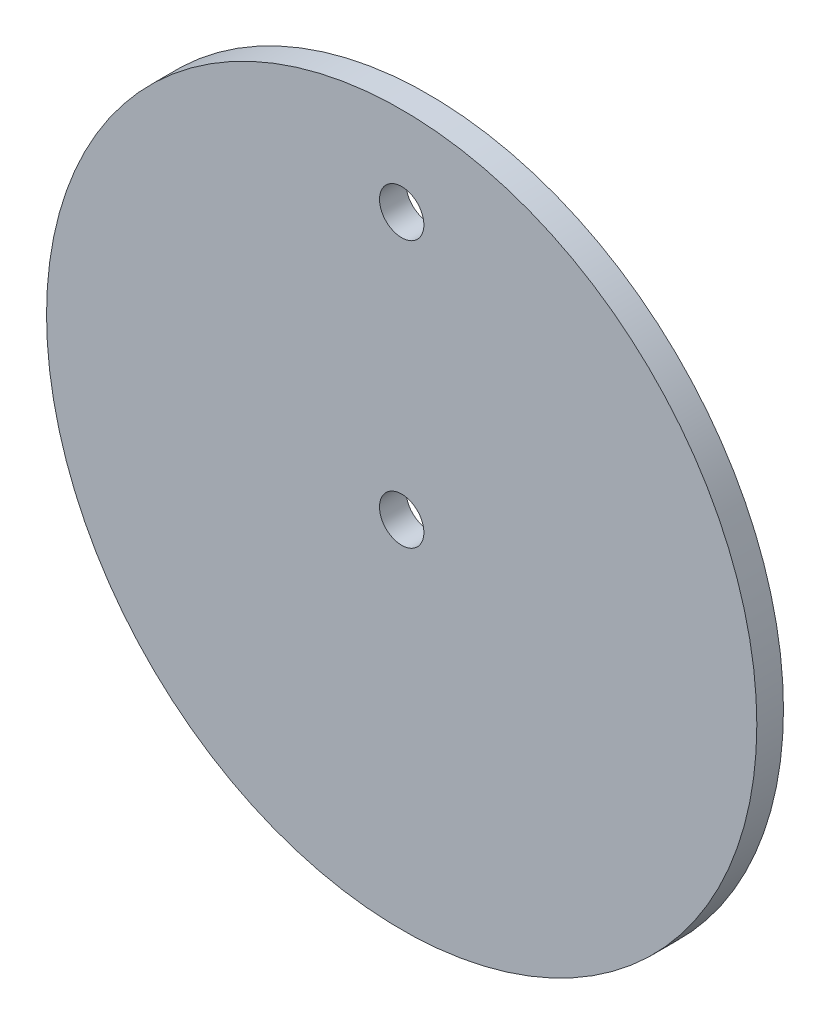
ISO-10303-21;
HEADER;
FILE_DESCRIPTION(('STEP AP214'),'2;1');
FILE_NAME('part.step','',(''),(''),'','','');
FILE_SCHEMA(('AUTOMOTIVE_DESIGN { 1 0 10303 214 1 1 1 1 }'));
ENDSEC;
DATA;
#1=APPLICATION_CONTEXT('core data for automotive mechanical design processes');
#2=APPLICATION_PROTOCOL_DEFINITION('international standard','automotive_design',2000,#1);
#3=PRODUCT_CONTEXT('',#1,'mechanical');
#4=PRODUCT('Part','Part','',(#3));
#5=PRODUCT_RELATED_PRODUCT_CATEGORY('part','',(#4));
#6=PRODUCT_DEFINITION_FORMATION('','',#4);
#7=PRODUCT_DEFINITION_CONTEXT('part definition',#1,'design');
#8=PRODUCT_DEFINITION('design','',#6,#7);
#9=PRODUCT_DEFINITION_SHAPE('','',#8);
#10=(LENGTH_UNIT() NAMED_UNIT(*) SI_UNIT(.MILLI.,.METRE.));
#11=(NAMED_UNIT(*) PLANE_ANGLE_UNIT() SI_UNIT($,.RADIAN.));
#12=(NAMED_UNIT(*) SI_UNIT($,.STERADIAN.) SOLID_ANGLE_UNIT());
#13=UNCERTAINTY_MEASURE_WITH_UNIT(LENGTH_MEASURE(1.E-05),#10,'distance_accuracy_value','');
#14=(GEOMETRIC_REPRESENTATION_CONTEXT(3) GLOBAL_UNCERTAINTY_ASSIGNED_CONTEXT((#13)) GLOBAL_UNIT_ASSIGNED_CONTEXT((#10,
#11,#12)) REPRESENTATION_CONTEXT('',''));
#15=CARTESIAN_POINT('',(0.,0.,0.));
#16=DIRECTION('',(0.,0.,1.));
#17=DIRECTION('',(1.,0.,0.));
#18=AXIS2_PLACEMENT_3D('',#15,#16,#17);
#19=CARTESIAN_POINT('',(0.,0.,3.));
#20=DIRECTION('',(0.,0.,1.));
#21=DIRECTION('',(1.,0.,0.));
#22=AXIS2_PLACEMENT_3D('',#19,#20,#21);
#23=PLANE('',#22);
#24=CARTESIAN_POINT('',(0.,0.,3.));
#25=DIRECTION('',(0.,0.,1.));
#26=DIRECTION('',(1.,0.,0.));
#27=AXIS2_PLACEMENT_3D('',#24,#25,#26);
#28=CIRCLE('',#27,2.5);
#29=CARTESIAN_POINT('',(2.5,0.,3.));
#30=VERTEX_POINT('',#29);
#31=EDGE_CURVE('E40',#30,#30,#28,.T.);
#32=ORIENTED_EDGE('',*,*,#31,.F.);
#33=EDGE_LOOP('',(#32));
#34=FACE_BOUND('',#33,.T.);
#35=CARTESIAN_POINT('',(0.,0.,3.));
#36=DIRECTION('',(0.,0.,1.));
#37=DIRECTION('',(1.,0.,0.));
#38=AXIS2_PLACEMENT_3D('',#35,#36,#37);
#39=CIRCLE('',#38,40.);
#40=CARTESIAN_POINT('',(40.,0.,3.));
#41=VERTEX_POINT('',#40);
#42=EDGE_CURVE('E10',#41,#41,#39,.T.);
#43=ORIENTED_EDGE('',*,*,#42,.T.);
#44=EDGE_LOOP('',(#43));
#45=FACE_BOUND('',#44,.T.);
#46=CARTESIAN_POINT('',(0.,30.,3.));
#47=DIRECTION('',(0.,0.,1.));
#48=DIRECTION('',(1.,0.,0.));
#49=AXIS2_PLACEMENT_3D('',#46,#47,#48);
#50=CIRCLE('',#49,2.5);
#51=CARTESIAN_POINT('',(2.5,30.,3.));
#52=VERTEX_POINT('',#51);
#53=EDGE_CURVE('E49',#52,#52,#50,.T.);
#54=ORIENTED_EDGE('',*,*,#53,.F.);
#55=EDGE_LOOP('',(#54));
#56=FACE_BOUND('',#55,.T.);
#57=ADVANCED_FACE('F29',(#34,#45,#56),#23,.T.);
#58=CARTESIAN_POINT('',(0.,0.,0.));
#59=DIRECTION('',(0.,0.,1.));
#60=DIRECTION('',(1.,0.,0.));
#61=AXIS2_PLACEMENT_3D('',#58,#59,#60);
#62=PLANE('',#61);
#63=CARTESIAN_POINT('',(0.,0.,0.));
#64=DIRECTION('',(0.,0.,1.));
#65=DIRECTION('',(1.,0.,0.));
#66=AXIS2_PLACEMENT_3D('',#63,#64,#65);
#67=CIRCLE('',#66,2.5);
#68=CARTESIAN_POINT('',(2.5,0.,0.));
#69=VERTEX_POINT('',#68);
#70=EDGE_CURVE('E44',#69,#69,#67,.T.);
#71=ORIENTED_EDGE('',*,*,#70,.T.);
#72=EDGE_LOOP('',(#71));
#73=FACE_BOUND('',#72,.T.);
#74=CARTESIAN_POINT('',(0.,0.,0.));
#75=DIRECTION('',(0.,0.,1.));
#76=DIRECTION('',(1.,0.,0.));
#77=AXIS2_PLACEMENT_3D('',#74,#75,#76);
#78=CIRCLE('',#77,40.);
#79=CARTESIAN_POINT('',(40.,0.,0.));
#80=VERTEX_POINT('',#79);
#81=EDGE_CURVE('E36',#80,#80,#78,.T.);
#82=ORIENTED_EDGE('',*,*,#81,.F.);
#83=EDGE_LOOP('',(#82));
#84=FACE_BOUND('',#83,.T.);
#85=CARTESIAN_POINT('',(0.,30.,0.));
#86=DIRECTION('',(0.,0.,1.));
#87=DIRECTION('',(1.,0.,0.));
#88=AXIS2_PLACEMENT_3D('',#85,#86,#87);
#89=CIRCLE('',#88,2.5);
#90=CARTESIAN_POINT('',(2.5,30.,0.));
#91=VERTEX_POINT('',#90);
#92=EDGE_CURVE('E52',#91,#91,#89,.T.);
#93=ORIENTED_EDGE('',*,*,#92,.T.);
#94=EDGE_LOOP('',(#93));
#95=FACE_BOUND('',#94,.T.);
#96=ADVANCED_FACE('F56',(#73,#84,#95),#62,.F.);
#97=CARTESIAN_POINT('',(0.,0.,3.));
#98=DIRECTION('',(0.,0.,-1.));
#99=DIRECTION('',(-1.,0.,0.));
#100=AXIS2_PLACEMENT_3D('',#97,#98,#99);
#101=CYLINDRICAL_SURFACE('',#100,40.);
#102=ORIENTED_EDGE('',*,*,#42,.F.);
#103=EDGE_LOOP('',(#102));
#104=FACE_BOUND('',#103,.T.);
#105=ORIENTED_EDGE('',*,*,#81,.T.);
#106=EDGE_LOOP('',(#105));
#107=FACE_BOUND('',#106,.T.);
#108=ADVANCED_FACE('F31',(#104,#107),#101,.T.);
#109=CARTESIAN_POINT('',(0.,0.,3.));
#110=DIRECTION('',(0.,0.,-1.));
#111=DIRECTION('',(-1.,0.,0.));
#112=AXIS2_PLACEMENT_3D('',#109,#110,#111);
#113=CYLINDRICAL_SURFACE('',#112,2.5);
#114=ORIENTED_EDGE('',*,*,#31,.T.);
#115=EDGE_LOOP('',(#114));
#116=FACE_BOUND('',#115,.T.);
#117=ORIENTED_EDGE('',*,*,#70,.F.);
#118=EDGE_LOOP('',(#117));
#119=FACE_BOUND('',#118,.T.);
#120=ADVANCED_FACE('F60',(#116,#119),#113,.F.);
#121=CARTESIAN_POINT('',(0.,30.,3.));
#122=DIRECTION('',(0.,0.,-1.));
#123=DIRECTION('',(-1.,0.,0.));
#124=AXIS2_PLACEMENT_3D('',#121,#122,#123);
#125=CYLINDRICAL_SURFACE('',#124,2.5);
#126=ORIENTED_EDGE('',*,*,#53,.T.);
#127=EDGE_LOOP('',(#126));
#128=FACE_BOUND('',#127,.T.);
#129=ORIENTED_EDGE('',*,*,#92,.F.);
#130=EDGE_LOOP('',(#129));
#131=FACE_BOUND('',#130,.T.);
#132=ADVANCED_FACE('F58',(#128,#131),#125,.F.);
#133=CLOSED_SHELL('',(#57,#96,#108,#120,#132));
#134=MANIFOLD_SOLID_BREP('B2',#133);
#135=ADVANCED_BREP_SHAPE_REPRESENTATION('',(#18,#134),#14);
#136=SHAPE_DEFINITION_REPRESENTATION(#9,#135);
ENDSEC;
END-ISO-10303-21;
